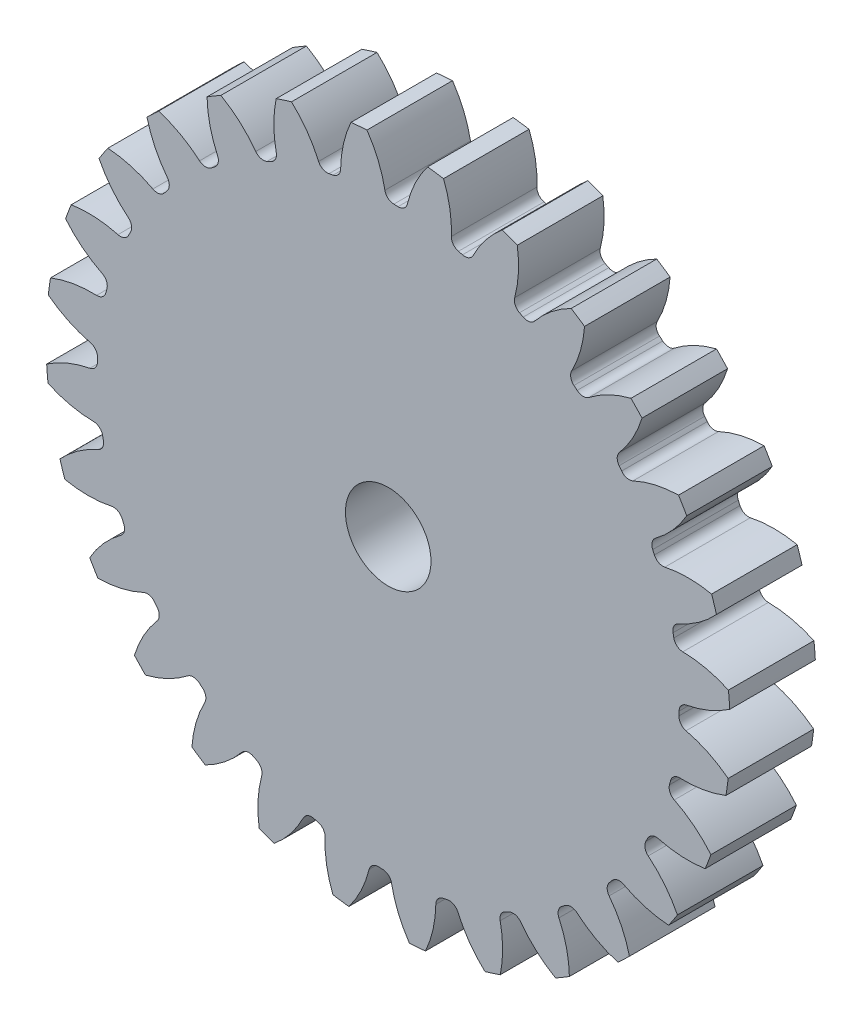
from build123d import *

# Parameters (mm, degrees)
SKETCH3_R         = 508
GEARBODY_DEPTH    = 127
TOOTHCUT_DEPTH    = 730.55945611
CIRPATTERN1_COUNT = 28
BOREDIA_R         = 63.5
BORE_DEPTH        = 12700


with BuildPart() as part:
    # Sketch3 → gearBody (new body)
    with BuildSketch(Plane.XY):
        Circle(SKETCH3_R)
    extrude(amount=GEARBODY_DEPTH)

    # Sketch2 → toothCut (cut, through all)
    with BuildSketch(Plane.XY):
        with BuildLine():
            ThreePointArc((431.554173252, -14.568306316), (431.647744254, -11.465813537), (431.719011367, -8.362728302))
            ThreePointArc((431.719011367, -8.362728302), (434.972276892, 0.26722954), (442.938919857, 4.914003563))
            ThreePointArc((442.938919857, 4.914003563), (476.916827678, 15.14148625), (508, 32.256860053))
            ThreePointArc((508, 32.256860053), (508.843603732, -13.516359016), (505.571165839, -59.180244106))
            ThreePointArc((505.571165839, -59.180244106), (475.440453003, -40.438852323), (442.053420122, -28.421961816))
            ThreePointArc((442.053420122, -28.421961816), (434.344701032, -23.358804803), (431.554173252, -14.568306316))
        make_face()
    toothcut = extrude(amount=TOOTHCUT_DEPTH, mode=Mode.SUBTRACT)

    # CirPattern1: toothCut ×28 about axis
    cirpattern1_axis = Axis((0, 0, 0), (0, 0, 1))
    for i in range(1, CIRPATTERN1_COUNT):
        add(toothcut.rotate(cirpattern1_axis, i * 360 / CIRPATTERN1_COUNT), mode=Mode.SUBTRACT)

    # boreDia → bore (cut, symmetric)
    with BuildSketch(Plane.XY):
        Circle(BOREDIA_R)
    extrude(amount=BORE_DEPTH, both=True, mode=Mode.SUBTRACT)


solid = part.part
